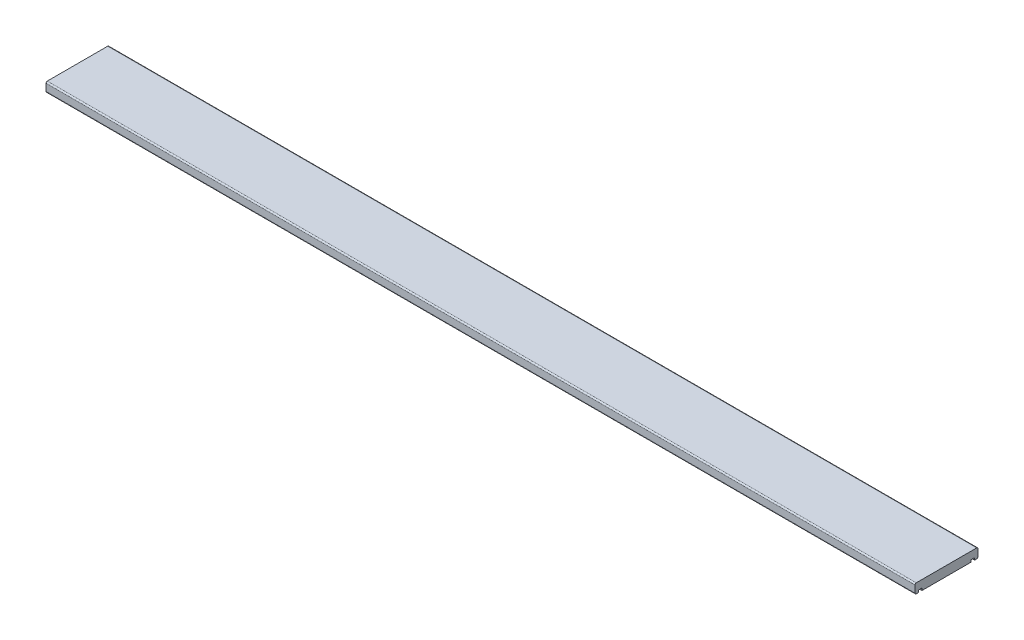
ISO-10303-21;
HEADER;
FILE_DESCRIPTION(('STEP AP214'),'2;1');
FILE_NAME('part.step','',(''),(''),'','','');
FILE_SCHEMA(('AUTOMOTIVE_DESIGN { 1 0 10303 214 1 1 1 1 }'));
ENDSEC;
DATA;
#1=APPLICATION_CONTEXT('core data for automotive mechanical design processes');
#2=APPLICATION_PROTOCOL_DEFINITION('international standard','automotive_design',2000,#1);
#3=PRODUCT_CONTEXT('',#1,'mechanical');
#4=PRODUCT('Part','Part','',(#3));
#5=PRODUCT_RELATED_PRODUCT_CATEGORY('part','',(#4));
#6=PRODUCT_DEFINITION_FORMATION('','',#4);
#7=PRODUCT_DEFINITION_CONTEXT('part definition',#1,'design');
#8=PRODUCT_DEFINITION('design','',#6,#7);
#9=PRODUCT_DEFINITION_SHAPE('','',#8);
#10=(LENGTH_UNIT() NAMED_UNIT(*) SI_UNIT(.MILLI.,.METRE.));
#11=(NAMED_UNIT(*) PLANE_ANGLE_UNIT() SI_UNIT($,.RADIAN.));
#12=(NAMED_UNIT(*) SI_UNIT($,.STERADIAN.) SOLID_ANGLE_UNIT());
#13=UNCERTAINTY_MEASURE_WITH_UNIT(LENGTH_MEASURE(1.E-05),#10,'distance_accuracy_value','');
#14=(GEOMETRIC_REPRESENTATION_CONTEXT(3) GLOBAL_UNCERTAINTY_ASSIGNED_CONTEXT((#13)) GLOBAL_UNIT_ASSIGNED_CONTEXT((#10,
#11,#12)) REPRESENTATION_CONTEXT('',''));
#15=CARTESIAN_POINT('',(0.,0.,0.));
#16=DIRECTION('',(0.,0.,1.));
#17=DIRECTION('',(1.,0.,0.));
#18=AXIS2_PLACEMENT_3D('',#15,#16,#17);
#19=CARTESIAN_POINT('',(1000.,0.,72.5));
#20=DIRECTION('',(0.,1.,0.));
#21=DIRECTION('',(0.,0.,1.));
#22=AXIS2_PLACEMENT_3D('',#19,#20,#21);
#23=PLANE('',#22);
#24=DIRECTION('',(1.,0.,0.));
#25=VECTOR('',#24,1.);
#26=CARTESIAN_POINT('',(-1000.001,0.,56.5));
#27=LINE('',#26,#25);
#28=CARTESIAN_POINT('',(-1000.,0.,56.5));
#29=VERTEX_POINT('',#28);
#30=CARTESIAN_POINT('',(1000.,0.,56.5));
#31=VERTEX_POINT('',#30);
#32=EDGE_CURVE('E140',#29,#31,#27,.T.);
#33=ORIENTED_EDGE('',*,*,#32,.F.);
#34=DIRECTION('',(0.,0.,-1.));
#35=VECTOR('',#34,1.);
#36=CARTESIAN_POINT('',(-1000.,0.,72.5));
#37=LINE('',#36,#35);
#38=CARTESIAN_POINT('',(-1000.,0.,-56.5));
#39=VERTEX_POINT('',#38);
#40=EDGE_CURVE('E235',#29,#39,#37,.T.);
#41=ORIENTED_EDGE('',*,*,#40,.T.);
#42=DIRECTION('',(1.,0.,0.));
#43=VECTOR('',#42,1.);
#44=CARTESIAN_POINT('',(-1000.001,0.,-56.5));
#45=LINE('',#44,#43);
#46=CARTESIAN_POINT('',(1000.,0.,-56.5));
#47=VERTEX_POINT('',#46);
#48=EDGE_CURVE('E165',#39,#47,#45,.T.);
#49=ORIENTED_EDGE('',*,*,#48,.T.);
#50=DIRECTION('',(0.,0.,-1.));
#51=VECTOR('',#50,1.);
#52=CARTESIAN_POINT('',(1000.,0.,72.5));
#53=LINE('',#52,#51);
#54=EDGE_CURVE('E156',#31,#47,#53,.T.);
#55=ORIENTED_EDGE('',*,*,#54,.F.);
#56=EDGE_LOOP('',(#33,#41,#49,#55));
#57=FACE_BOUND('',#56,.T.);
#58=ADVANCED_FACE('F26',(#57),#23,.F.);
#59=CARTESIAN_POINT('',(1000.,0.,69.5));
#60=VERTEX_POINT('',#59);
#61=CARTESIAN_POINT('',(1000.,0.,64.5));
#62=VERTEX_POINT('',#61);
#63=EDGE_CURVE('E166',#60,#62,#53,.T.);
#64=ORIENTED_EDGE('',*,*,#63,.F.);
#65=DIRECTION('',(-1.,0.,0.));
#66=VECTOR('',#65,1.);
#67=CARTESIAN_POINT('',(1000.,0.,69.5));
#68=LINE('',#67,#66);
#69=CARTESIAN_POINT('',(-1000.,0.,69.5));
#70=VERTEX_POINT('',#69);
#71=EDGE_CURVE('E176',#60,#70,#68,.T.);
#72=ORIENTED_EDGE('',*,*,#71,.T.);
#73=CARTESIAN_POINT('',(-1000.,0.,64.5));
#74=VERTEX_POINT('',#73);
#75=EDGE_CURVE('E233',#70,#74,#37,.T.);
#76=ORIENTED_EDGE('',*,*,#75,.T.);
#77=DIRECTION('',(1.,0.,0.));
#78=VECTOR('',#77,1.);
#79=CARTESIAN_POINT('',(-1000.001,0.,64.5));
#80=LINE('',#79,#78);
#81=EDGE_CURVE('E151',#74,#62,#80,.T.);
#82=ORIENTED_EDGE('',*,*,#81,.T.);
#83=EDGE_LOOP('',(#64,#72,#76,#82));
#84=FACE_BOUND('',#83,.T.);
#85=ADVANCED_FACE('F283',(#84),#23,.F.);
#86=CARTESIAN_POINT('',(1000.,22.,-72.5));
#87=DIRECTION('',(-1.,0.,0.));
#88=DIRECTION('',(0.,0.,1.));
#89=AXIS2_PLACEMENT_3D('',#86,#87,#88);
#90=PLANE('',#89);
#91=DIRECTION('',(0.,-1.,0.));
#92=VECTOR('',#91,1.);
#93=CARTESIAN_POINT('',(1000.,22.,72.5));
#94=LINE('',#93,#92);
#95=CARTESIAN_POINT('',(1000.,19.,72.5));
#96=VERTEX_POINT('',#95);
#97=CARTESIAN_POINT('',(1000.,3.,72.5));
#98=VERTEX_POINT('',#97);
#99=EDGE_CURVE('E171',#96,#98,#94,.T.);
#100=ORIENTED_EDGE('',*,*,#99,.T.);
#101=CARTESIAN_POINT('',(1000.,3.,69.5));
#102=DIRECTION('',(-1.,0.,0.));
#103=DIRECTION('',(0.,0.,1.));
#104=AXIS2_PLACEMENT_3D('',#101,#102,#103);
#105=CIRCLE('',#104,3.);
#106=EDGE_CURVE('E197',#98,#60,#105,.F.);
#107=ORIENTED_EDGE('',*,*,#106,.T.);
#108=ORIENTED_EDGE('',*,*,#63,.T.);
#109=DIRECTION('',(0.,-1.,0.));
#110=VECTOR('',#109,1.);
#111=CARTESIAN_POINT('',(1000.,0.,64.5));
#112=LINE('',#111,#110);
#113=CARTESIAN_POINT('',(1000.,5.,64.5));
#114=VERTEX_POINT('',#113);
#115=EDGE_CURVE('E274',#114,#62,#112,.T.);
#116=ORIENTED_EDGE('',*,*,#115,.F.);
#117=DIRECTION('',(0.,0.,1.));
#118=VECTOR('',#117,1.);
#119=CARTESIAN_POINT('',(1000.,5.,56.5));
#120=LINE('',#119,#118);
#121=CARTESIAN_POINT('',(1000.,5.,56.5));
#122=VERTEX_POINT('',#121);
#123=EDGE_CURVE('E160',#122,#114,#120,.T.);
#124=ORIENTED_EDGE('',*,*,#123,.F.);
#125=DIRECTION('',(0.,1.,0.));
#126=VECTOR('',#125,1.);
#127=CARTESIAN_POINT('',(1000.,0.,56.5));
#128=LINE('',#127,#126);
#129=EDGE_CURVE('E143',#31,#122,#128,.T.);
#130=ORIENTED_EDGE('',*,*,#129,.F.);
#131=ORIENTED_EDGE('',*,*,#54,.T.);
#132=DIRECTION('',(0.,-1.,0.));
#133=VECTOR('',#132,1.);
#134=CARTESIAN_POINT('',(1000.,0.,-56.5));
#135=LINE('',#134,#133);
#136=CARTESIAN_POINT('',(1000.,5.00000000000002,-56.5));
#137=VERTEX_POINT('',#136);
#138=EDGE_CURVE('E260',#137,#47,#135,.T.);
#139=ORIENTED_EDGE('',*,*,#138,.F.);
#140=DIRECTION('',(0.,0.,1.));
#141=VECTOR('',#140,1.);
#142=CARTESIAN_POINT('',(1000.,5.00000000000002,-56.5));
#143=LINE('',#142,#141);
#144=CARTESIAN_POINT('',(1000.,5.00000000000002,-64.5));
#145=VERTEX_POINT('',#144);
#146=EDGE_CURVE('E257',#145,#137,#143,.T.);
#147=ORIENTED_EDGE('',*,*,#146,.F.);
#148=DIRECTION('',(0.,1.,0.));
#149=VECTOR('',#148,1.);
#150=CARTESIAN_POINT('',(1000.,0.,-64.5));
#151=LINE('',#150,#149);
#152=CARTESIAN_POINT('',(1000.,0.,-64.5));
#153=VERTEX_POINT('',#152);
#154=EDGE_CURVE('E219',#153,#145,#151,.T.);
#155=ORIENTED_EDGE('',*,*,#154,.F.);
#156=CARTESIAN_POINT('',(1000.,0.,-69.5));
#157=VERTEX_POINT('',#156);
#158=EDGE_CURVE('E167',#153,#157,#53,.T.);
#159=ORIENTED_EDGE('',*,*,#158,.T.);
#160=CARTESIAN_POINT('',(1000.,3.,-69.5));
#161=DIRECTION('',(-1.,0.,0.));
#162=DIRECTION('',(0.,0.,1.));
#163=AXIS2_PLACEMENT_3D('',#160,#161,#162);
#164=CIRCLE('',#163,3.);
#165=CARTESIAN_POINT('',(1000.,3.,-72.5));
#166=VERTEX_POINT('',#165);
#167=EDGE_CURVE('E195',#157,#166,#164,.F.);
#168=ORIENTED_EDGE('',*,*,#167,.T.);
#169=DIRECTION('',(0.,1.,0.));
#170=VECTOR('',#169,1.);
#171=CARTESIAN_POINT('',(1000.,22.,-72.5));
#172=LINE('',#171,#170);
#173=CARTESIAN_POINT('',(1000.,19.,-72.5));
#174=VERTEX_POINT('',#173);
#175=EDGE_CURVE('E169',#166,#174,#172,.T.);
#176=ORIENTED_EDGE('',*,*,#175,.T.);
#177=CARTESIAN_POINT('',(1000.,19.,-69.5));
#178=DIRECTION('',(-1.,0.,0.));
#179=DIRECTION('',(0.,0.,1.));
#180=AXIS2_PLACEMENT_3D('',#177,#178,#179);
#181=CIRCLE('',#180,3.);
#182=CARTESIAN_POINT('',(1000.,22.,-69.5));
#183=VERTEX_POINT('',#182);
#184=EDGE_CURVE('E47',#174,#183,#181,.F.);
#185=ORIENTED_EDGE('',*,*,#184,.T.);
#186=DIRECTION('',(0.,0.,1.));
#187=VECTOR('',#186,1.);
#188=CARTESIAN_POINT('',(1000.,22.,72.5));
#189=LINE('',#188,#187);
#190=CARTESIAN_POINT('',(1000.,22.,69.5));
#191=VERTEX_POINT('',#190);
#192=EDGE_CURVE('E232',#183,#191,#189,.T.);
#193=ORIENTED_EDGE('',*,*,#192,.T.);
#194=CARTESIAN_POINT('',(1000.,19.,69.5));
#195=DIRECTION('',(-1.,0.,0.));
#196=DIRECTION('',(0.,0.,1.));
#197=AXIS2_PLACEMENT_3D('',#194,#195,#196);
#198=CIRCLE('',#197,3.);
#199=EDGE_CURVE('E192',#191,#96,#198,.F.);
#200=ORIENTED_EDGE('',*,*,#199,.T.);
#201=EDGE_LOOP('',(#100,#107,#108,#116,#124,#130,#131,#139,#147,#155,#159,#168,#176,#185,#193,#200));
#202=FACE_BOUND('',#201,.T.);
#203=ADVANCED_FACE('F154',(#202),#90,.F.);
#204=CARTESIAN_POINT('',(-1000.,22.,-72.5));
#205=DIRECTION('',(-1.,0.,0.));
#206=DIRECTION('',(0.,0.,1.));
#207=AXIS2_PLACEMENT_3D('',#204,#205,#206);
#208=PLANE('',#207);
#209=ORIENTED_EDGE('',*,*,#75,.F.);
#210=CARTESIAN_POINT('',(-1000.,3.,69.5));
#211=DIRECTION('',(-1.,0.,0.));
#212=DIRECTION('',(0.,0.,1.));
#213=AXIS2_PLACEMENT_3D('',#210,#211,#212);
#214=CIRCLE('',#213,3.);
#215=CARTESIAN_POINT('',(-1000.,3.,72.5));
#216=VERTEX_POINT('',#215);
#217=EDGE_CURVE('E185',#70,#216,#214,.T.);
#218=ORIENTED_EDGE('',*,*,#217,.T.);
#219=DIRECTION('',(0.,-1.,0.));
#220=VECTOR('',#219,1.);
#221=CARTESIAN_POINT('',(-1000.,22.,72.5));
#222=LINE('',#221,#220);
#223=CARTESIAN_POINT('',(-1000.,19.,72.5));
#224=VERTEX_POINT('',#223);
#225=EDGE_CURVE('E238',#224,#216,#222,.T.);
#226=ORIENTED_EDGE('',*,*,#225,.F.);
#227=CARTESIAN_POINT('',(-1000.,19.,69.5));
#228=DIRECTION('',(-1.,0.,0.));
#229=DIRECTION('',(0.,0.,1.));
#230=AXIS2_PLACEMENT_3D('',#227,#228,#229);
#231=CIRCLE('',#230,3.);
#232=CARTESIAN_POINT('',(-1000.,22.,69.5));
#233=VERTEX_POINT('',#232);
#234=EDGE_CURVE('E179',#224,#233,#231,.T.);
#235=ORIENTED_EDGE('',*,*,#234,.T.);
#236=DIRECTION('',(0.,0.,1.));
#237=VECTOR('',#236,1.);
#238=CARTESIAN_POINT('',(-1000.,22.,72.5));
#239=LINE('',#238,#237);
#240=CARTESIAN_POINT('',(-1000.,22.,-69.5));
#241=VERTEX_POINT('',#240);
#242=EDGE_CURVE('E241',#241,#233,#239,.T.);
#243=ORIENTED_EDGE('',*,*,#242,.F.);
#244=CARTESIAN_POINT('',(-1000.,19.,-69.5));
#245=DIRECTION('',(-1.,0.,0.));
#246=DIRECTION('',(0.,0.,1.));
#247=AXIS2_PLACEMENT_3D('',#244,#245,#246);
#248=CIRCLE('',#247,3.);
#249=CARTESIAN_POINT('',(-1000.,19.,-72.5));
#250=VERTEX_POINT('',#249);
#251=EDGE_CURVE('E181',#241,#250,#248,.T.);
#252=ORIENTED_EDGE('',*,*,#251,.T.);
#253=DIRECTION('',(0.,1.,0.));
#254=VECTOR('',#253,1.);
#255=CARTESIAN_POINT('',(-1000.,22.,-72.5));
#256=LINE('',#255,#254);
#257=CARTESIAN_POINT('',(-1000.,3.,-72.5));
#258=VERTEX_POINT('',#257);
#259=EDGE_CURVE('E226',#258,#250,#256,.T.);
#260=ORIENTED_EDGE('',*,*,#259,.F.);
#261=CARTESIAN_POINT('',(-1000.,3.,-69.5));
#262=DIRECTION('',(-1.,0.,0.));
#263=DIRECTION('',(0.,0.,1.));
#264=AXIS2_PLACEMENT_3D('',#261,#262,#263);
#265=CIRCLE('',#264,3.);
#266=CARTESIAN_POINT('',(-1000.,0.,-69.5));
#267=VERTEX_POINT('',#266);
#268=EDGE_CURVE('E183',#258,#267,#265,.T.);
#269=ORIENTED_EDGE('',*,*,#268,.T.);
#270=CARTESIAN_POINT('',(-1000.,0.,-64.5));
#271=VERTEX_POINT('',#270);
#272=EDGE_CURVE('E212',#271,#267,#37,.T.);
#273=ORIENTED_EDGE('',*,*,#272,.F.);
#274=DIRECTION('',(0.,-1.,0.));
#275=VECTOR('',#274,1.);
#276=CARTESIAN_POINT('',(-1000.,0.,-64.5));
#277=LINE('',#276,#275);
#278=CARTESIAN_POINT('',(-1000.,5.00000000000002,-64.5));
#279=VERTEX_POINT('',#278);
#280=EDGE_CURVE('E255',#279,#271,#277,.T.);
#281=ORIENTED_EDGE('',*,*,#280,.F.);
#282=DIRECTION('',(0.,0.,-1.));
#283=VECTOR('',#282,1.);
#284=CARTESIAN_POINT('',(-1000.,5.00000000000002,-56.5));
#285=LINE('',#284,#283);
#286=CARTESIAN_POINT('',(-1000.,5.00000000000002,-56.5));
#287=VERTEX_POINT('',#286);
#288=EDGE_CURVE('E253',#287,#279,#285,.T.);
#289=ORIENTED_EDGE('',*,*,#288,.F.);
#290=DIRECTION('',(0.,1.,0.));
#291=VECTOR('',#290,1.);
#292=CARTESIAN_POINT('',(-1000.,0.,-56.5));
#293=LINE('',#292,#291);
#294=EDGE_CURVE('E250',#39,#287,#293,.T.);
#295=ORIENTED_EDGE('',*,*,#294,.F.);
#296=ORIENTED_EDGE('',*,*,#40,.F.);
#297=DIRECTION('',(0.,-1.,0.));
#298=VECTOR('',#297,1.);
#299=CARTESIAN_POINT('',(-1000.,0.,56.5));
#300=LINE('',#299,#298);
#301=CARTESIAN_POINT('',(-1000.,5.,56.5));
#302=VERTEX_POINT('',#301);
#303=EDGE_CURVE('E146',#302,#29,#300,.T.);
#304=ORIENTED_EDGE('',*,*,#303,.F.);
#305=DIRECTION('',(0.,0.,-1.));
#306=VECTOR('',#305,1.);
#307=CARTESIAN_POINT('',(-1000.,5.,56.5));
#308=LINE('',#307,#306);
#309=CARTESIAN_POINT('',(-1000.,5.,64.5));
#310=VERTEX_POINT('',#309);
#311=EDGE_CURVE('E150',#310,#302,#308,.T.);
#312=ORIENTED_EDGE('',*,*,#311,.F.);
#313=DIRECTION('',(0.,1.,0.));
#314=VECTOR('',#313,1.);
#315=CARTESIAN_POINT('',(-1000.,0.,64.5));
#316=LINE('',#315,#314);
#317=EDGE_CURVE('E161',#74,#310,#316,.T.);
#318=ORIENTED_EDGE('',*,*,#317,.F.);
#319=EDGE_LOOP('',(#209,#218,#226,#235,#243,#252,#260,#269,#273,#281,#289,#295,#296,#304,#312,#318));
#320=FACE_BOUND('',#319,.T.);
#321=ADVANCED_FACE('F230',(#320),#208,.T.);
#322=ORIENTED_EDGE('',*,*,#272,.T.);
#323=DIRECTION('',(-1.,0.,0.));
#324=VECTOR('',#323,1.);
#325=CARTESIAN_POINT('',(1000.,0.,-69.5));
#326=LINE('',#325,#324);
#327=EDGE_CURVE('E204',#267,#157,#326,.F.);
#328=ORIENTED_EDGE('',*,*,#327,.T.);
#329=ORIENTED_EDGE('',*,*,#158,.F.);
#330=DIRECTION('',(1.,0.,0.));
#331=VECTOR('',#330,1.);
#332=CARTESIAN_POINT('',(-1000.001,0.,-64.5));
#333=LINE('',#332,#331);
#334=EDGE_CURVE('E247',#271,#153,#333,.T.);
#335=ORIENTED_EDGE('',*,*,#334,.F.);
#336=EDGE_LOOP('',(#322,#328,#329,#335));
#337=FACE_BOUND('',#336,.T.);
#338=ADVANCED_FACE('F209',(#337),#23,.F.);
#339=CARTESIAN_POINT('',(1000.,22.,72.5));
#340=DIRECTION('',(0.,-1.,0.));
#341=DIRECTION('',(0.,0.,-1.));
#342=AXIS2_PLACEMENT_3D('',#339,#340,#341);
#343=PLANE('',#342);
#344=ORIENTED_EDGE('',*,*,#192,.F.);
#345=DIRECTION('',(-1.,0.,0.));
#346=VECTOR('',#345,1.);
#347=CARTESIAN_POINT('',(1000.,22.,-69.5));
#348=LINE('',#347,#346);
#349=EDGE_CURVE('E11',#183,#241,#348,.T.);
#350=ORIENTED_EDGE('',*,*,#349,.T.);
#351=ORIENTED_EDGE('',*,*,#242,.T.);
#352=DIRECTION('',(-1.,0.,0.));
#353=VECTOR('',#352,1.);
#354=CARTESIAN_POINT('',(1000.,22.,69.5));
#355=LINE('',#354,#353);
#356=EDGE_CURVE('E34',#233,#191,#355,.F.);
#357=ORIENTED_EDGE('',*,*,#356,.T.);
#358=EDGE_LOOP('',(#344,#350,#351,#357));
#359=FACE_BOUND('',#358,.T.);
#360=ADVANCED_FACE('F28',(#359),#343,.F.);
#361=CARTESIAN_POINT('',(1000.,22.,72.5));
#362=DIRECTION('',(0.,0.,-1.));
#363=DIRECTION('',(-1.,0.,0.));
#364=AXIS2_PLACEMENT_3D('',#361,#362,#363);
#365=PLANE('',#364);
#366=ORIENTED_EDGE('',*,*,#225,.T.);
#367=DIRECTION('',(-1.,0.,0.));
#368=VECTOR('',#367,1.);
#369=CARTESIAN_POINT('',(1000.,3.,72.5));
#370=LINE('',#369,#368);
#371=EDGE_CURVE('E190',#216,#98,#370,.F.);
#372=ORIENTED_EDGE('',*,*,#371,.T.);
#373=ORIENTED_EDGE('',*,*,#99,.F.);
#374=DIRECTION('',(-1.,0.,0.));
#375=VECTOR('',#374,1.);
#376=CARTESIAN_POINT('',(1000.,19.,72.5));
#377=LINE('',#376,#375);
#378=EDGE_CURVE('E187',#96,#224,#377,.T.);
#379=ORIENTED_EDGE('',*,*,#378,.T.);
#380=EDGE_LOOP('',(#366,#372,#373,#379));
#381=FACE_BOUND('',#380,.T.);
#382=ADVANCED_FACE('F319',(#381),#365,.F.);
#383=CARTESIAN_POINT('',(1000.,22.,-72.5));
#384=DIRECTION('',(0.,0.,1.));
#385=DIRECTION('',(1.,0.,0.));
#386=AXIS2_PLACEMENT_3D('',#383,#384,#385);
#387=PLANE('',#386);
#388=ORIENTED_EDGE('',*,*,#175,.F.);
#389=DIRECTION('',(-1.,0.,0.));
#390=VECTOR('',#389,1.);
#391=CARTESIAN_POINT('',(1000.,3.,-72.5));
#392=LINE('',#391,#390);
#393=EDGE_CURVE('E201',#166,#258,#392,.T.);
#394=ORIENTED_EDGE('',*,*,#393,.T.);
#395=ORIENTED_EDGE('',*,*,#259,.T.);
#396=DIRECTION('',(-1.,0.,0.));
#397=VECTOR('',#396,1.);
#398=CARTESIAN_POINT('',(1000.,19.,-72.5));
#399=LINE('',#398,#397);
#400=EDGE_CURVE('E199',#250,#174,#399,.F.);
#401=ORIENTED_EDGE('',*,*,#400,.T.);
#402=EDGE_LOOP('',(#388,#394,#395,#401));
#403=FACE_BOUND('',#402,.T.);
#404=ADVANCED_FACE('F225',(#403),#387,.F.);
#405=CARTESIAN_POINT('',(-1000.001,0.,-56.5));
#406=DIRECTION('',(0.,0.,-1.));
#407=DIRECTION('',(0.,1.,0.));
#408=AXIS2_PLACEMENT_3D('',#405,#406,#407);
#409=PLANE('',#408);
#410=ORIENTED_EDGE('',*,*,#294,.T.);
#411=DIRECTION('',(1.,0.,0.));
#412=VECTOR('',#411,1.);
#413=CARTESIAN_POINT('',(-1000.001,5.00000000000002,-56.5));
#414=LINE('',#413,#412);
#415=EDGE_CURVE('E243',#287,#137,#414,.T.);
#416=ORIENTED_EDGE('',*,*,#415,.T.);
#417=ORIENTED_EDGE('',*,*,#138,.T.);
#418=ORIENTED_EDGE('',*,*,#48,.F.);
#419=EDGE_LOOP('',(#410,#416,#417,#418));
#420=FACE_BOUND('',#419,.T.);
#421=ADVANCED_FACE('F292',(#420),#409,.T.);
#422=CARTESIAN_POINT('',(-1000.001,5.00000000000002,-56.5));
#423=DIRECTION('',(0.,-1.,0.));
#424=DIRECTION('',(0.,0.,-1.));
#425=AXIS2_PLACEMENT_3D('',#422,#423,#424);
#426=PLANE('',#425);
#427=ORIENTED_EDGE('',*,*,#288,.T.);
#428=DIRECTION('',(1.,0.,0.));
#429=VECTOR('',#428,1.);
#430=CARTESIAN_POINT('',(-1000.001,5.00000000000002,-64.5));
#431=LINE('',#430,#429);
#432=EDGE_CURVE('E245',#279,#145,#431,.T.);
#433=ORIENTED_EDGE('',*,*,#432,.T.);
#434=ORIENTED_EDGE('',*,*,#146,.T.);
#435=ORIENTED_EDGE('',*,*,#415,.F.);
#436=EDGE_LOOP('',(#427,#433,#434,#435));
#437=FACE_BOUND('',#436,.T.);
#438=ADVANCED_FACE('F294',(#437),#426,.T.);
#439=CARTESIAN_POINT('',(-1000.001,0.,-64.5));
#440=DIRECTION('',(0.,0.,1.));
#441=DIRECTION('',(1.,0.,0.));
#442=AXIS2_PLACEMENT_3D('',#439,#440,#441);
#443=PLANE('',#442);
#444=ORIENTED_EDGE('',*,*,#280,.T.);
#445=ORIENTED_EDGE('',*,*,#334,.T.);
#446=ORIENTED_EDGE('',*,*,#154,.T.);
#447=ORIENTED_EDGE('',*,*,#432,.F.);
#448=EDGE_LOOP('',(#444,#445,#446,#447));
#449=FACE_BOUND('',#448,.T.);
#450=ADVANCED_FACE('F298',(#449),#443,.T.);
#451=CARTESIAN_POINT('',(-1000.001,0.,56.5));
#452=DIRECTION('',(0.,0.,1.));
#453=DIRECTION('',(0.,-1.,0.));
#454=AXIS2_PLACEMENT_3D('',#451,#452,#453);
#455=PLANE('',#454);
#456=ORIENTED_EDGE('',*,*,#303,.T.);
#457=ORIENTED_EDGE('',*,*,#32,.T.);
#458=ORIENTED_EDGE('',*,*,#129,.T.);
#459=DIRECTION('',(1.,0.,0.));
#460=VECTOR('',#459,1.);
#461=CARTESIAN_POINT('',(-1000.001,5.,56.5));
#462=LINE('',#461,#460);
#463=EDGE_CURVE('E269',#302,#122,#462,.T.);
#464=ORIENTED_EDGE('',*,*,#463,.F.);
#465=EDGE_LOOP('',(#456,#457,#458,#464));
#466=FACE_BOUND('',#465,.T.);
#467=ADVANCED_FACE('F142',(#466),#455,.T.);
#468=CARTESIAN_POINT('',(-1000.001,0.,64.5));
#469=DIRECTION('',(0.,0.,-1.));
#470=DIRECTION('',(-1.,0.,0.));
#471=AXIS2_PLACEMENT_3D('',#468,#469,#470);
#472=PLANE('',#471);
#473=ORIENTED_EDGE('',*,*,#317,.T.);
#474=DIRECTION('',(1.,0.,0.));
#475=VECTOR('',#474,1.);
#476=CARTESIAN_POINT('',(-1000.001,5.,64.5));
#477=LINE('',#476,#475);
#478=EDGE_CURVE('E267',#310,#114,#477,.T.);
#479=ORIENTED_EDGE('',*,*,#478,.T.);
#480=ORIENTED_EDGE('',*,*,#115,.T.);
#481=ORIENTED_EDGE('',*,*,#81,.F.);
#482=EDGE_LOOP('',(#473,#479,#480,#481));
#483=FACE_BOUND('',#482,.T.);
#484=ADVANCED_FACE('F278',(#483),#472,.T.);
#485=CARTESIAN_POINT('',(-1000.001,5.,56.5));
#486=DIRECTION('',(0.,-1.,0.));
#487=DIRECTION('',(0.,0.,-1.));
#488=AXIS2_PLACEMENT_3D('',#485,#486,#487);
#489=PLANE('',#488);
#490=ORIENTED_EDGE('',*,*,#311,.T.);
#491=ORIENTED_EDGE('',*,*,#463,.T.);
#492=ORIENTED_EDGE('',*,*,#123,.T.);
#493=ORIENTED_EDGE('',*,*,#478,.F.);
#494=EDGE_LOOP('',(#490,#491,#492,#493));
#495=FACE_BOUND('',#494,.T.);
#496=ADVANCED_FACE('F288',(#495),#489,.T.);
#497=CARTESIAN_POINT('',(1000.,3.,69.5));
#498=DIRECTION('',(-1.,0.,0.));
#499=DIRECTION('',(0.,0.,1.));
#500=AXIS2_PLACEMENT_3D('',#497,#498,#499);
#501=CYLINDRICAL_SURFACE('',#500,3.);
#502=ORIENTED_EDGE('',*,*,#106,.F.);
#503=ORIENTED_EDGE('',*,*,#371,.F.);
#504=ORIENTED_EDGE('',*,*,#217,.F.);
#505=ORIENTED_EDGE('',*,*,#71,.F.);
#506=EDGE_LOOP('',(#502,#503,#504,#505));
#507=FACE_BOUND('',#506,.T.);
#508=ADVANCED_FACE('F339',(#507),#501,.T.);
#509=CARTESIAN_POINT('',(1000.,3.,-69.5));
#510=DIRECTION('',(-1.,0.,0.));
#511=DIRECTION('',(0.,0.,1.));
#512=AXIS2_PLACEMENT_3D('',#509,#510,#511);
#513=CYLINDRICAL_SURFACE('',#512,3.);
#514=ORIENTED_EDGE('',*,*,#167,.F.);
#515=ORIENTED_EDGE('',*,*,#327,.F.);
#516=ORIENTED_EDGE('',*,*,#268,.F.);
#517=ORIENTED_EDGE('',*,*,#393,.F.);
#518=EDGE_LOOP('',(#514,#515,#516,#517));
#519=FACE_BOUND('',#518,.T.);
#520=ADVANCED_FACE('F221',(#519),#513,.T.);
#521=CARTESIAN_POINT('',(1000.,19.,-69.5));
#522=DIRECTION('',(-1.,0.,0.));
#523=DIRECTION('',(0.,0.,1.));
#524=AXIS2_PLACEMENT_3D('',#521,#522,#523);
#525=CYLINDRICAL_SURFACE('',#524,3.);
#526=ORIENTED_EDGE('',*,*,#184,.F.);
#527=ORIENTED_EDGE('',*,*,#400,.F.);
#528=ORIENTED_EDGE('',*,*,#251,.F.);
#529=ORIENTED_EDGE('',*,*,#349,.F.);
#530=EDGE_LOOP('',(#526,#527,#528,#529));
#531=FACE_BOUND('',#530,.T.);
#532=ADVANCED_FACE('F345',(#531),#525,.T.);
#533=CARTESIAN_POINT('',(1000.,19.,69.5));
#534=DIRECTION('',(-1.,0.,0.));
#535=DIRECTION('',(0.,0.,1.));
#536=AXIS2_PLACEMENT_3D('',#533,#534,#535);
#537=CYLINDRICAL_SURFACE('',#536,3.);
#538=ORIENTED_EDGE('',*,*,#199,.F.);
#539=ORIENTED_EDGE('',*,*,#356,.F.);
#540=ORIENTED_EDGE('',*,*,#234,.F.);
#541=ORIENTED_EDGE('',*,*,#378,.F.);
#542=EDGE_LOOP('',(#538,#539,#540,#541));
#543=FACE_BOUND('',#542,.T.);
#544=ADVANCED_FACE('F342',(#543),#537,.T.);
#545=CLOSED_SHELL('',(#58,#85,#203,#321,#338,#360,#382,#404,#421,#438,#450,#467,#484,#496,#508,
#520,#532,#544));
#546=MANIFOLD_SOLID_BREP('B2',#545);
#547=ADVANCED_BREP_SHAPE_REPRESENTATION('',(#18,#546),#14);
#548=SHAPE_DEFINITION_REPRESENTATION(#9,#547);
ENDSEC;
END-ISO-10303-21;
